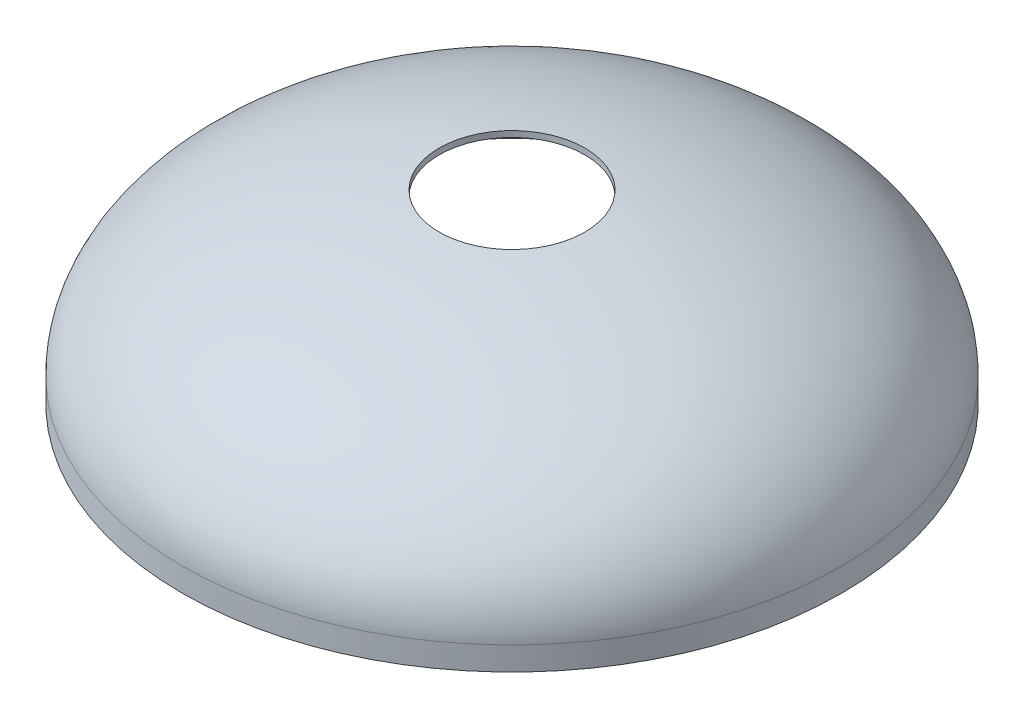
ISO-10303-21;
HEADER;
FILE_DESCRIPTION(('STEP AP214'),'2;1');
FILE_NAME('part.step','',(''),(''),'','','');
FILE_SCHEMA(('AUTOMOTIVE_DESIGN { 1 0 10303 214 1 1 1 1 }'));
ENDSEC;
DATA;
#1=APPLICATION_CONTEXT('core data for automotive mechanical design processes');
#2=APPLICATION_PROTOCOL_DEFINITION('international standard','automotive_design',2000,#1);
#3=PRODUCT_CONTEXT('',#1,'mechanical');
#4=PRODUCT('Part','Part','',(#3));
#5=PRODUCT_RELATED_PRODUCT_CATEGORY('part','',(#4));
#6=PRODUCT_DEFINITION_FORMATION('','',#4);
#7=PRODUCT_DEFINITION_CONTEXT('part definition',#1,'design');
#8=PRODUCT_DEFINITION('design','',#6,#7);
#9=PRODUCT_DEFINITION_SHAPE('','',#8);
#10=(LENGTH_UNIT() NAMED_UNIT(*) SI_UNIT(.MILLI.,.METRE.));
#11=(NAMED_UNIT(*) PLANE_ANGLE_UNIT() SI_UNIT($,.RADIAN.));
#12=(NAMED_UNIT(*) SI_UNIT($,.STERADIAN.) SOLID_ANGLE_UNIT());
#13=UNCERTAINTY_MEASURE_WITH_UNIT(LENGTH_MEASURE(1.E-05),#10,'distance_accuracy_value','');
#14=(GEOMETRIC_REPRESENTATION_CONTEXT(3) GLOBAL_UNCERTAINTY_ASSIGNED_CONTEXT((#13)) GLOBAL_UNIT_ASSIGNED_CONTEXT((#10,
#11,#12)) REPRESENTATION_CONTEXT('',''));
#15=CARTESIAN_POINT('',(0.,0.,0.));
#16=DIRECTION('',(0.,0.,1.));
#17=DIRECTION('',(1.,0.,0.));
#18=AXIS2_PLACEMENT_3D('',#15,#16,#17);
#19=CARTESIAN_POINT('',(0.,0.,0.));
#20=DIRECTION('',(0.,0.,1.));
#21=DIRECTION('',(-1.,0.,0.));
#22=AXIS2_PLACEMENT_3D('',#19,#20,#21);
#23=ELLIPSE('',#22,711.2,355.6);
#24=TRIMMED_CURVE('',#23,(PARAMETER_VALUE(1.5707963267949)),(PARAMETER_VALUE(4.71238898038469)),
.T.,.PARAMETER.);
#25=CARTESIAN_POINT('',(0.,441.323897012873,0.));
#26=DIRECTION('',(0.,1.,0.));
#27=AXIS1_PLACEMENT('',#25,#26);
#28=SURFACE_OF_REVOLUTION('',#24,#27);
#29=CARTESIAN_POINT('',(0.,0.,0.));
#30=DIRECTION('',(0.,1.,0.));
#31=DIRECTION('',(-1.,0.,0.));
#32=AXIS2_PLACEMENT_3D('',#29,#30,#31);
#33=CIRCLE('',#32,711.2);
#34=CARTESIAN_POINT('',(-711.2,0.,0.));
#35=VERTEX_POINT('',#34);
#36=EDGE_CURVE('E50',#35,#35,#33,.T.);
#37=ORIENTED_EDGE('',*,*,#36,.T.);
#38=EDGE_LOOP('',(#37));
#39=FACE_BOUND('',#38,.T.);
#40=CARTESIAN_POINT('',(0.,346.808804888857,0.));
#41=DIRECTION('',(0.,1.,0.));
#42=DIRECTION('',(-1.,0.,0.));
#43=AXIS2_PLACEMENT_3D('',#40,#41,#42);
#44=CIRCLE('',#43,157.1625);
#45=CARTESIAN_POINT('',(0.,346.808804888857,-157.1625));
#46=VERTEX_POINT('',#45);
#47=EDGE_CURVE('E89',#46,#46,#44,.T.);
#48=ORIENTED_EDGE('',*,*,#47,.F.);
#49=EDGE_LOOP('',(#48));
#50=FACE_BOUND('',#49,.T.);
#51=ADVANCED_FACE('F39',(#39,#50),#28,.T.);
#52=CARTESIAN_POINT('',(0.,0.,0.));
#53=DIRECTION('',(0.,0.,1.));
#54=DIRECTION('',(-1.,0.,0.));
#55=AXIS2_PLACEMENT_3D('',#52,#53,#54);
#56=ELLIPSE('',#55,711.2,355.6);
#57=TRIMMED_CURVE('',#56,(PARAMETER_VALUE(1.5707963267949)),(PARAMETER_VALUE(4.71238898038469)),
.T.,.PARAMETER.);
#58=CARTESIAN_POINT('',(0.,441.323897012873,0.));
#59=DIRECTION('',(0.,1.,0.));
#60=AXIS1_PLACEMENT('',#58,#59);
#61=SURFACE_OF_REVOLUTION('',#57,#60);
#62=OFFSET_SURFACE('',#61,-12.7,.F.);
#63=CARTESIAN_POINT('',(0.,0.,0.));
#64=DIRECTION('',(0.,1.,0.));
#65=DIRECTION('',(1.,0.,0.));
#66=AXIS2_PLACEMENT_3D('',#63,#64,#65);
#67=CIRCLE('',#66,698.5);
#68=CARTESIAN_POINT('',(698.5,0.,0.));
#69=VERTEX_POINT('',#68);
#70=EDGE_CURVE('E95',#69,#69,#67,.T.);
#71=ORIENTED_EDGE('',*,*,#70,.F.);
#72=EDGE_LOOP('',(#71));
#73=FACE_BOUND('',#72,.T.);
#74=CARTESIAN_POINT('',(0.,334.026779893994,0.));
#75=DIRECTION('',(0.,1.,0.));
#76=DIRECTION('',(-1.,0.,0.));
#77=AXIS2_PLACEMENT_3D('',#74,#75,#76);
#78=CIRCLE('',#77,157.162500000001);
#79=CARTESIAN_POINT('',(0.,334.026779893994,-157.1625));
#80=VERTEX_POINT('',#79);
#81=EDGE_CURVE('E43',#80,#80,#78,.T.);
#82=ORIENTED_EDGE('',*,*,#81,.T.);
#83=EDGE_LOOP('',(#82));
#84=FACE_BOUND('',#83,.T.);
#85=ADVANCED_FACE('F65',(#73,#84),#62,.F.);
#86=CARTESIAN_POINT('',(711.2,-50.8,0.));
#87=DIRECTION('',(0.,1.,0.));
#88=DIRECTION('',(-1.,0.,0.));
#89=AXIS2_PLACEMENT_3D('',#86,#87,#88);
#90=PLANE('',#89);
#91=CARTESIAN_POINT('',(0.,-50.8000000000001,0.));
#92=DIRECTION('',(0.,1.,0.));
#93=DIRECTION('',(-1.,0.,0.));
#94=AXIS2_PLACEMENT_3D('',#91,#92,#93);
#95=CIRCLE('',#94,698.5);
#96=CARTESIAN_POINT('',(-698.5,-50.8000000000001,0.));
#97=VERTEX_POINT('',#96);
#98=EDGE_CURVE('E51',#97,#97,#95,.T.);
#99=ORIENTED_EDGE('',*,*,#98,.T.);
#100=EDGE_LOOP('',(#99));
#101=FACE_BOUND('',#100,.T.);
#102=CARTESIAN_POINT('',(0.,-50.8,0.));
#103=DIRECTION('',(0.,1.,0.));
#104=DIRECTION('',(-1.,0.,0.));
#105=AXIS2_PLACEMENT_3D('',#102,#103,#104);
#106=CIRCLE('',#105,711.2);
#107=CARTESIAN_POINT('',(-711.2,-50.8,0.));
#108=VERTEX_POINT('',#107);
#109=EDGE_CURVE('E10',#108,#108,#106,.T.);
#110=ORIENTED_EDGE('',*,*,#109,.F.);
#111=EDGE_LOOP('',(#110));
#112=FACE_BOUND('',#111,.T.);
#113=ADVANCED_FACE('F71',(#101,#112),#90,.F.);
#114=CARTESIAN_POINT('',(0.,441.323897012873,0.));
#115=DIRECTION('',(0.,1.,0.));
#116=DIRECTION('',(-1.,0.,0.));
#117=AXIS2_PLACEMENT_3D('',#114,#115,#116);
#118=CYLINDRICAL_SURFACE('',#117,711.2);
#119=ORIENTED_EDGE('',*,*,#36,.F.);
#120=EDGE_LOOP('',(#119));
#121=FACE_BOUND('',#120,.T.);
#122=ORIENTED_EDGE('',*,*,#109,.T.);
#123=EDGE_LOOP('',(#122));
#124=FACE_BOUND('',#123,.T.);
#125=ADVANCED_FACE('F70',(#121,#124),#118,.T.);
#126=CARTESIAN_POINT('',(0.,441.323897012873,0.));
#127=DIRECTION('',(0.,1.,0.));
#128=DIRECTION('',(-1.,0.,0.));
#129=AXIS2_PLACEMENT_3D('',#126,#127,#128);
#130=CYLINDRICAL_SURFACE('',#129,698.5);
#131=ORIENTED_EDGE('',*,*,#70,.T.);
#132=EDGE_LOOP('',(#131));
#133=FACE_BOUND('',#132,.T.);
#134=ORIENTED_EDGE('',*,*,#98,.F.);
#135=EDGE_LOOP('',(#134));
#136=FACE_BOUND('',#135,.T.);
#137=ADVANCED_FACE('F61',(#133,#136),#130,.F.);
#138=CARTESIAN_POINT('',(0.,456.946,0.));
#139=DIRECTION('',(0.,-1.,0.));
#140=DIRECTION('',(0.,0.,-1.));
#141=AXIS2_PLACEMENT_3D('',#138,#139,#140);
#142=CYLINDRICAL_SURFACE('',#141,157.1625);
#143=CARTESIAN_POINT('',(0.,334.026779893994,-157.1625));
#144=CARTESIAN_POINT('',(0.,334.159925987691,-157.1625));
#145=CARTESIAN_POINT('',(0.,334.293072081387,-157.1625));
#146=CARTESIAN_POINT('',(0.,334.55936426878,-157.1625));
#147=CARTESIAN_POINT('',(0.,334.692510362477,-157.1625));
#148=CARTESIAN_POINT('',(0.,334.95880254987,-157.1625));
#149=CARTESIAN_POINT('',(0.,335.091948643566,-157.1625));
#150=CARTESIAN_POINT('',(0.,335.358240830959,-157.1625));
#151=CARTESIAN_POINT('',(0.,335.491386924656,-157.1625));
#152=CARTESIAN_POINT('',(0.,335.757679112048,-157.1625));
#153=CARTESIAN_POINT('',(0.,335.890825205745,-157.1625));
#154=CARTESIAN_POINT('',(0.,336.157117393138,-157.1625));
#155=CARTESIAN_POINT('',(0.,336.290263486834,-157.1625));
#156=CARTESIAN_POINT('',(0.,336.556555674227,-157.1625));
#157=CARTESIAN_POINT('',(0.,336.689701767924,-157.1625));
#158=CARTESIAN_POINT('',(0.,336.955993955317,-157.1625));
#159=CARTESIAN_POINT('',(0.,337.089140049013,-157.1625));
#160=CARTESIAN_POINT('',(0.,337.355432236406,-157.1625));
#161=CARTESIAN_POINT('',(0.,337.488578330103,-157.1625));
#162=CARTESIAN_POINT('',(0.,337.754870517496,-157.1625));
#163=CARTESIAN_POINT('',(0.,337.888016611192,-157.1625));
#164=CARTESIAN_POINT('',(0.,338.154308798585,-157.1625));
#165=CARTESIAN_POINT('',(0.,338.287454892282,-157.1625));
#166=CARTESIAN_POINT('',(0.,338.553747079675,-157.1625));
#167=CARTESIAN_POINT('',(0.,338.686893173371,-157.1625));
#168=CARTESIAN_POINT('',(0.,338.953185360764,-157.1625));
#169=CARTESIAN_POINT('',(0.,339.086331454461,-157.1625));
#170=CARTESIAN_POINT('',(0.,339.352623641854,-157.1625));
#171=CARTESIAN_POINT('',(0.,339.48576973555,-157.1625));
#172=CARTESIAN_POINT('',(0.,339.752061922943,-157.1625));
#173=CARTESIAN_POINT('',(0.,339.88520801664,-157.1625));
#174=CARTESIAN_POINT('',(0.,340.151500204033,-157.1625));
#175=CARTESIAN_POINT('',(0.,340.284646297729,-157.1625));
#176=CARTESIAN_POINT('',(0.,340.550938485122,-157.1625));
#177=CARTESIAN_POINT('',(0.,340.684084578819,-157.1625));
#178=CARTESIAN_POINT('',(0.,340.950376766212,-157.1625));
#179=CARTESIAN_POINT('',(0.,341.083522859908,-157.1625));
#180=CARTESIAN_POINT('',(0.,341.349815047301,-157.1625));
#181=CARTESIAN_POINT('',(0.,341.482961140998,-157.1625));
#182=CARTESIAN_POINT('',(0.,341.749253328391,-157.1625));
#183=CARTESIAN_POINT('',(0.,341.882399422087,-157.1625));
#184=CARTESIAN_POINT('',(0.,342.14869160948,-157.1625));
#185=CARTESIAN_POINT('',(0.,342.281837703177,-157.1625));
#186=CARTESIAN_POINT('',(0.,342.54812989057,-157.1625));
#187=CARTESIAN_POINT('',(0.,342.681275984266,-157.1625));
#188=CARTESIAN_POINT('',(0.,342.947568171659,-157.1625));
#189=CARTESIAN_POINT('',(0.,343.080714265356,-157.1625));
#190=CARTESIAN_POINT('',(0.,343.347006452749,-157.1625));
#191=CARTESIAN_POINT('',(0.,343.480152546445,-157.1625));
#192=CARTESIAN_POINT('',(0.,343.746444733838,-157.1625));
#193=CARTESIAN_POINT('',(0.,343.879590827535,-157.1625));
#194=CARTESIAN_POINT('',(0.,344.145883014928,-157.1625));
#195=CARTESIAN_POINT('',(0.,344.279029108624,-157.1625));
#196=CARTESIAN_POINT('',(0.,344.545321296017,-157.1625));
#197=CARTESIAN_POINT('',(0.,344.678467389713,-157.1625));
#198=CARTESIAN_POINT('',(0.,344.944759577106,-157.1625));
#199=CARTESIAN_POINT('',(0.,345.077905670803,-157.1625));
#200=CARTESIAN_POINT('',(0.,345.344197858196,-157.1625));
#201=CARTESIAN_POINT('',(0.,345.477343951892,-157.1625));
#202=CARTESIAN_POINT('',(0.,345.743636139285,-157.1625));
#203=CARTESIAN_POINT('',(0.,345.876782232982,-157.1625));
#204=CARTESIAN_POINT('',(0.,346.143074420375,-157.1625));
#205=CARTESIAN_POINT('',(0.,346.276220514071,-157.1625));
#206=CARTESIAN_POINT('',(0.,346.542512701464,-157.1625));
#207=CARTESIAN_POINT('',(0.,346.675658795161,-157.1625));
#208=CARTESIAN_POINT('',(0.,346.808804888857,-157.1625));
#209=B_SPLINE_CURVE_WITH_KNOTS('',3,(#143,#144,#145,#146,#147,#148,#149,#150,#151,#152,#153,
#154,#155,#156,#157,#158,#159,#160,#161,#162,#163,#164,#165,#166,#167,#168,#169,#170,#171,#172,
#173,#174,#175,#176,#177,#178,#179,#180,#181,#182,#183,#184,#185,#186,#187,#188,#189,#190,#191,
#192,#193,#194,#195,#196,#197,#198,#199,#200,#201,#202,#203,#204,#205,#206,#207,#208),
.UNSPECIFIED.,.F.,.F.,(4,2,2,2,2,2,2,2,2,2,2,2,2,2,2,2,2,2,2,2,2,2,2,2,2,2,2,2,2,2,2,2,4),(0.,
0.399438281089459,0.798876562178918,1.19831484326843,1.59775312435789,1.99719140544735,
2.39662968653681,2.79606796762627,3.19550624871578,3.59494452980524,3.99438281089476,
4.39382109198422,4.79325937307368,5.19269765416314,5.5921359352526,5.99157421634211,
6.39101249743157,6.79045077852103,7.18988905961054,7.5893273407,7.98876562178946,
8.38820390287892,8.78764218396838,9.1870804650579,9.58651874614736,9.98595702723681,
10.3853953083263,10.7848335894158,11.1842718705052,11.5837101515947,11.9831484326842,
12.3825867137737,12.7820249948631),.UNSPECIFIED.);
#210=EDGE_CURVE('BSEAM66',#80,#46,#209,.T.);
#211=ORIENTED_EDGE('',*,*,#81,.F.);
#212=ORIENTED_EDGE('',*,*,#47,.T.);
#213=ORIENTED_EDGE('',*,*,#210,.T.);
#214=ORIENTED_EDGE('',*,*,#210,.F.);
#215=EDGE_LOOP('',(#211,#213,#212,#214));
#216=FACE_BOUND('',#215,.T.);
#217=ADVANCED_FACE('F66',(#216),#142,.F.);
#218=CLOSED_SHELL('',(#51,#85,#113,#125,#137,#217));
#219=MANIFOLD_SOLID_BREP('B2',#218);
#220=ADVANCED_BREP_SHAPE_REPRESENTATION('',(#18,#219),#14);
#221=SHAPE_DEFINITION_REPRESENTATION(#9,#220);
ENDSEC;
END-ISO-10303-21;
